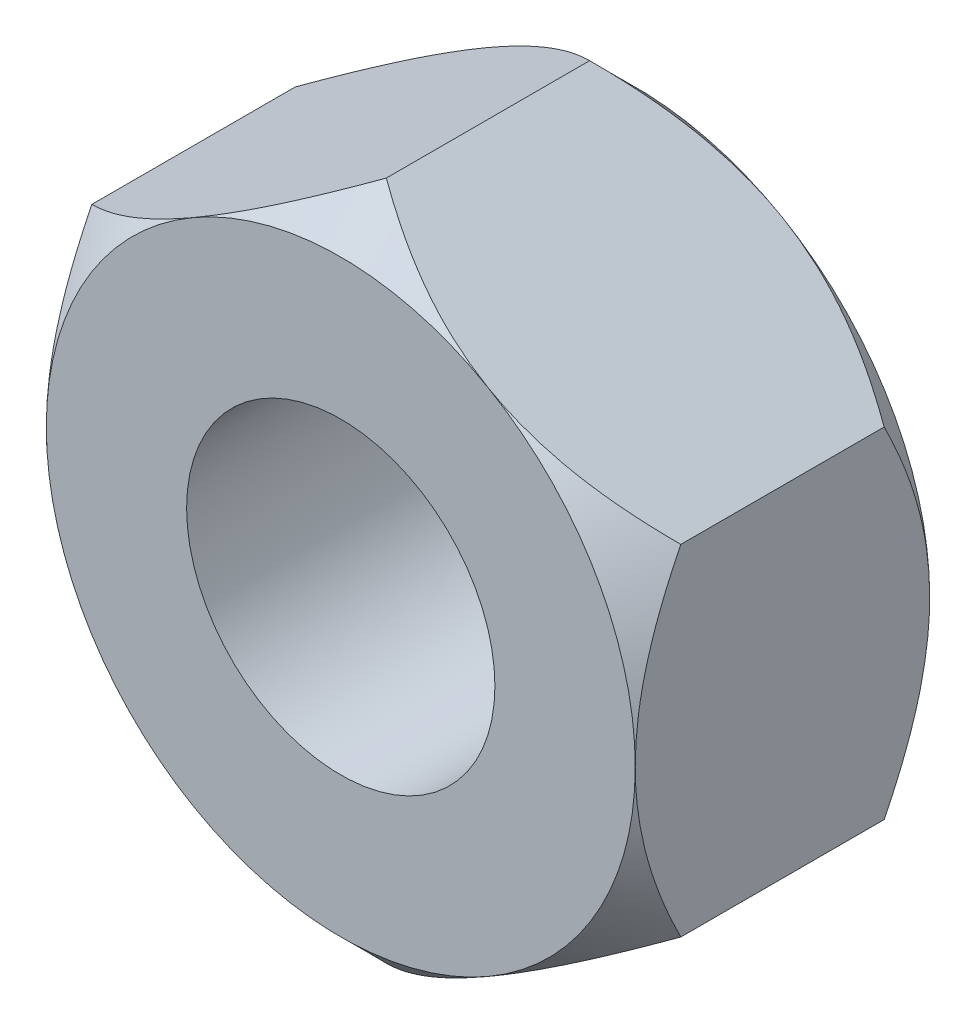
ISO-10303-21;
HEADER;
FILE_DESCRIPTION(('STEP AP214'),'2;1');
FILE_NAME('part.step','',(''),(''),'','','');
FILE_SCHEMA(('AUTOMOTIVE_DESIGN { 1 0 10303 214 1 1 1 1 }'));
ENDSEC;
DATA;
#1=APPLICATION_CONTEXT('core data for automotive mechanical design processes');
#2=APPLICATION_PROTOCOL_DEFINITION('international standard','automotive_design',2000,#1);
#3=PRODUCT_CONTEXT('',#1,'mechanical');
#4=PRODUCT('Part','Part','',(#3));
#5=PRODUCT_RELATED_PRODUCT_CATEGORY('part','',(#4));
#6=PRODUCT_DEFINITION_FORMATION('','',#4);
#7=PRODUCT_DEFINITION_CONTEXT('part definition',#1,'design');
#8=PRODUCT_DEFINITION('design','',#6,#7);
#9=PRODUCT_DEFINITION_SHAPE('','',#8);
#10=(LENGTH_UNIT() NAMED_UNIT(*) SI_UNIT(.MILLI.,.METRE.));
#11=(NAMED_UNIT(*) PLANE_ANGLE_UNIT() SI_UNIT($,.RADIAN.));
#12=(NAMED_UNIT(*) SI_UNIT($,.STERADIAN.) SOLID_ANGLE_UNIT());
#13=UNCERTAINTY_MEASURE_WITH_UNIT(LENGTH_MEASURE(1.E-05),#10,'distance_accuracy_value','');
#14=(GEOMETRIC_REPRESENTATION_CONTEXT(3) GLOBAL_UNCERTAINTY_ASSIGNED_CONTEXT((#13)) GLOBAL_UNIT_ASSIGNED_CONTEXT((#10,
#11,#12)) REPRESENTATION_CONTEXT('',''));
#15=CARTESIAN_POINT('',(0.,0.,0.));
#16=DIRECTION('',(0.,0.,1.));
#17=DIRECTION('',(1.,0.,0.));
#18=AXIS2_PLACEMENT_3D('',#15,#16,#17);
#19=CARTESIAN_POINT('',(-8.,4.61880215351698,4.));
#20=DIRECTION('',(-0.500000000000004,0.866025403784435,0.));
#21=DIRECTION('',(-0.866025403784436,-0.500000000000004,0.));
#22=AXIS2_PLACEMENT_3D('',#19,#20,#21);
#23=PLANE('',#22);
#24=DIRECTION('',(0.,0.,-1.));
#25=VECTOR('',#24,1.);
#26=CARTESIAN_POINT('',(-8.,4.61880215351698,4.));
#27=LINE('',#26,#25);
#28=CARTESIAN_POINT('',(-8.,4.61880215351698,2.76239569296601));
#29=VERTEX_POINT('',#28);
#30=CARTESIAN_POINT('',(-8.,4.61880215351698,-2.76239569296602));
#31=VERTEX_POINT('',#30);
#32=EDGE_CURVE('E205',#29,#31,#27,.T.);
#33=ORIENTED_EDGE('',*,*,#32,.F.);
#34=CARTESIAN_POINT('',(-8.00019999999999,4.61868668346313,2.76228022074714));
#35=CARTESIAN_POINT('',(-7.86264718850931,4.69810283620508,2.84168743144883));
#36=CARTESIAN_POINT('',(-7.72403708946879,4.77812941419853,2.91865771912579));
#37=CARTESIAN_POINT('',(-7.44449490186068,4.93952317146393,3.06698316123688));
#38=CARTESIAN_POINT('',(-7.3035615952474,5.0208910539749,3.13833524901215));
#39=CARTESIAN_POINT('',(-6.87565651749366,5.26794216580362,3.34346070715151));
#40=CARTESIAN_POINT('',(-6.58506238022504,5.43571676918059,3.46742824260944));
#41=CARTESIAN_POINT('',(-5.99905611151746,5.77404764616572,3.6797139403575));
#42=CARTESIAN_POINT('',(-5.70379374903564,5.94451745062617,3.76856690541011));
#43=CARTESIAN_POINT('',(-5.25604614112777,6.2030246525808,3.87134783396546));
#44=CARTESIAN_POINT('',(-5.10613774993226,6.28957430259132,3.90051131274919));
#45=CARTESIAN_POINT('',(-4.80505172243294,6.46340640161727,3.94801217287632));
#46=CARTESIAN_POINT('',(-4.65387427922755,6.55068873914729,3.96635117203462));
#47=CARTESIAN_POINT('',(-4.2854726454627,6.76338552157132,3.99709931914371));
#48=CARTESIAN_POINT('',(-4.06785151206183,6.88902914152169,4.00355065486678));
#49=CARTESIAN_POINT('',(-3.63300150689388,7.14008990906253,3.99272107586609));
#50=CARTESIAN_POINT('',(-3.4157727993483,7.26550696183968,3.97543184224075));
#51=CARTESIAN_POINT('',(-2.98336341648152,7.51515863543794,3.91814025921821));
#52=CARTESIAN_POINT('',(-2.76818530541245,7.63939177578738,3.87811251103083));
#53=CARTESIAN_POINT('',(-2.34152748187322,7.88572278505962,3.77752005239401));
#54=CARTESIAN_POINT('',(-2.13004748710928,8.00782081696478,3.71695691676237));
#55=CARTESIAN_POINT('',(-1.75463860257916,8.22456323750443,3.59236205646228));
#56=CARTESIAN_POINT('',(-1.58987832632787,8.31968762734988,3.53160757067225));
#57=CARTESIAN_POINT('',(-1.2633153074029,8.5082288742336,3.40030853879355));
#58=CARTESIAN_POINT('',(-1.10151265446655,8.601645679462,3.32976369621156));
#59=CARTESIAN_POINT('',(-0.781374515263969,8.78647752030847,3.18046522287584));
#60=CARTESIAN_POINT('',(-0.623029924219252,8.87789781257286,3.1017374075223));
#61=CARTESIAN_POINT('',(-0.309272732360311,9.0590456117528,2.93710651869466));
#62=CARTESIAN_POINT('',(-0.153858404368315,9.14877411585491,2.85120784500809));
#63=CARTESIAN_POINT('',(0.000200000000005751,9.23771977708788,2.7622802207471));
#64=B_SPLINE_CURVE_WITH_KNOTS('',3,(#34,#35,#36,#37,#38,#39,#40,#41,#42,#43,#44,#45,#46,#47,#48,
#49,#50,#51,#52,#53,#54,#55,#56,#57,#58,#59,#60,#61,#62,#63),.UNSPECIFIED.,.F.,.F.,(4,2,2,2,2,2,
2,2,2,2,2,2,2,2,4),(0.,0.532696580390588,1.06568194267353,2.13740664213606,3.19211397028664,
3.71843331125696,4.24467396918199,4.99761238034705,5.75081469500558,6.50485999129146,
7.25884747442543,7.85770857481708,8.45658781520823,9.05363199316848,9.65031250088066),.UNSPECIFIED.);
#65=CARTESIAN_POINT('',(-4.00000000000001,6.92820323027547,3.99999999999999));
#66=VERTEX_POINT('',#65);
#67=EDGE_CURVE('E129',#29,#66,#64,.T.);
#68=ORIENTED_EDGE('',*,*,#67,.T.);
#69=CARTESIAN_POINT('',(0.,9.23760430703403,2.76239569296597));
#70=VERTEX_POINT('',#69);
#71=EDGE_CURVE('E47',#66,#70,#64,.T.);
#72=ORIENTED_EDGE('',*,*,#71,.T.);
#73=DIRECTION('',(0.,0.,-1.));
#74=VECTOR('',#73,1.);
#75=CARTESIAN_POINT('',(0.,9.23760430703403,4.));
#76=LINE('',#75,#74);
#77=CARTESIAN_POINT('',(0.,9.23760430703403,-2.76239569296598));
#78=VERTEX_POINT('',#77);
#79=EDGE_CURVE('E258',#70,#78,#76,.T.);
#80=ORIENTED_EDGE('',*,*,#79,.T.);
#81=CARTESIAN_POINT('',(0.000200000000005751,9.23771977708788,-2.76228022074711));
#82=CARTESIAN_POINT('',(-0.137352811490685,9.15830362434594,-2.8416874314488));
#83=CARTESIAN_POINT('',(-0.27596291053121,9.07827704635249,-2.91865771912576));
#84=CARTESIAN_POINT('',(-0.555505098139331,8.91688328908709,-3.06698316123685));
#85=CARTESIAN_POINT('',(-0.696438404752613,8.83551540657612,-3.13833524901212));
#86=CARTESIAN_POINT('',(-1.12434348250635,8.58846429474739,-3.34346070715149));
#87=CARTESIAN_POINT('',(-1.41493761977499,8.42068969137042,-3.46742824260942));
#88=CARTESIAN_POINT('',(-2.00094388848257,8.08235881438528,-3.67971394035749));
#89=CARTESIAN_POINT('',(-2.2962062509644,7.91188900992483,-3.7685669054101));
#90=CARTESIAN_POINT('',(-2.74395385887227,7.6533818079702,-3.87134783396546));
#91=CARTESIAN_POINT('',(-2.8938622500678,7.56683215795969,-3.90051131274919));
#92=CARTESIAN_POINT('',(-3.19494827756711,7.39300005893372,-3.94801217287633));
#93=CARTESIAN_POINT('',(-3.3461257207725,7.30571772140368,-3.96635117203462));
#94=CARTESIAN_POINT('',(-3.71452735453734,7.09302093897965,-3.99709931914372));
#95=CARTESIAN_POINT('',(-3.93214848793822,6.9673773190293,-4.00355065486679));
#96=CARTESIAN_POINT('',(-4.36699849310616,6.71631655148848,-3.9927210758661));
#97=CARTESIAN_POINT('',(-4.58422720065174,6.59089949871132,-3.97543184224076));
#98=CARTESIAN_POINT('',(-5.01663658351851,6.34124782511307,-3.91814025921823));
#99=CARTESIAN_POINT('',(-5.23181469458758,6.21701468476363,-3.87811251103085));
#100=CARTESIAN_POINT('',(-5.6584725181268,5.97068367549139,-3.77752005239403));
#101=CARTESIAN_POINT('',(-5.86995251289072,5.8485856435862,-3.71695691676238));
#102=CARTESIAN_POINT('',(-6.24536139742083,5.63184322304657,-3.5923620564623));
#103=CARTESIAN_POINT('',(-6.41012167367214,5.53671883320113,-3.53160757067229));
#104=CARTESIAN_POINT('',(-6.73668469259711,5.34817758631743,-3.40030853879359));
#105=CARTESIAN_POINT('',(-6.89848734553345,5.25476078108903,-3.3297636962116));
#106=CARTESIAN_POINT('',(-7.21862548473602,5.06992894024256,-3.18046522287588));
#107=CARTESIAN_POINT('',(-7.37697007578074,4.97850864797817,-3.10173740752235));
#108=CARTESIAN_POINT('',(-7.69072726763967,4.79736084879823,-2.93710651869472));
#109=CARTESIAN_POINT('',(-7.84614159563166,4.70763234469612,-2.85120784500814));
#110=CARTESIAN_POINT('',(-8.00019999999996,4.61868668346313,-2.76228022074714));
#111=B_SPLINE_CURVE_WITH_KNOTS('',3,(#81,#82,#83,#84,#85,#86,#87,#88,#89,#90,#91,#92,#93,#94,
#95,#96,#97,#98,#99,#100,#101,#102,#103,#104,#105,#106,#107,#108,#109,#110),.UNSPECIFIED.,.F.,
.F.,(4,2,2,2,2,2,2,2,2,2,2,2,2,2,4),(0.,0.532696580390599,1.06568194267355,2.1374066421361,
3.1921139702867,3.71843331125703,4.24467396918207,4.99761238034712,5.75081469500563,
6.5048599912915,7.25884747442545,7.85770857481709,8.45658781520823,9.05363199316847,
9.65031250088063),.UNSPECIFIED.);
#112=CARTESIAN_POINT('',(-4.,6.92820323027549,-4.00000000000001));
#113=VERTEX_POINT('',#112);
#114=EDGE_CURVE('E200',#78,#113,#111,.T.);
#115=ORIENTED_EDGE('',*,*,#114,.T.);
#116=EDGE_CURVE('E197',#113,#31,#111,.T.);
#117=ORIENTED_EDGE('',*,*,#116,.T.);
#118=EDGE_LOOP('',(#33,#68,#72,#80,#115,#117));
#119=FACE_BOUND('',#118,.T.);
#120=ADVANCED_FACE('F32',(#119),#23,.T.);
#121=CARTESIAN_POINT('',(-8.,4.61880215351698,4.));
#122=DIRECTION('',(1.,0.,0.));
#123=DIRECTION('',(0.,1.,0.));
#124=AXIS2_PLACEMENT_3D('',#121,#122,#123);
#125=PLANE('',#124);
#126=CARTESIAN_POINT('',(-8.,-11.5676209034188,-2.06448909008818));
#127=CARTESIAN_POINT('',(-7.99999999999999,-11.2764434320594,-1.82506498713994));
#128=CARTESIAN_POINT('',(-7.99999999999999,-10.9838751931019,-1.58730576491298));
#129=CARTESIAN_POINT('',(-7.99999999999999,-10.3952440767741,-1.11600377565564));
#130=CARTESIAN_POINT('',(-7.99999999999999,-10.0991803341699,-0.882462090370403));
#131=CARTESIAN_POINT('',(-7.99999999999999,-9.49970837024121,-0.418060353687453));
#132=CARTESIAN_POINT('',(-7.99999999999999,-9.1962551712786,-0.187258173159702));
#133=CARTESIAN_POINT('',(-7.99999999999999,-8.58436142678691,0.267594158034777));
#134=CARTESIAN_POINT('',(-7.99999999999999,-8.27592137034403,0.491644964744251));
#135=CARTESIAN_POINT('',(-7.99999999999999,-7.62336356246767,0.952052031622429));
#136=CARTESIAN_POINT('',(-7.99999999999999,-7.27864037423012,1.18755489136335));
#137=CARTESIAN_POINT('',(-7.99999999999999,-6.58003782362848,1.64494735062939));
#138=CARTESIAN_POINT('',(-7.99999999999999,-6.22615547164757,1.86683242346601));
#139=CARTESIAN_POINT('',(-7.99999999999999,-5.50895275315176,2.29097102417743));
#140=CARTESIAN_POINT('',(-7.99999999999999,-5.14568402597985,2.49331118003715));
#141=CARTESIAN_POINT('',(-8.,-4.40610279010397,2.87240237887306));
#142=CARTESIAN_POINT('',(-8.,-4.02980207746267,3.0491758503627));
#143=CARTESIAN_POINT('',(-8.,-3.51033126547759,3.26459997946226));
#144=CARTESIAN_POINT('',(-8.,-3.37354003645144,3.31872721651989));
#145=CARTESIAN_POINT('',(-8.,-3.09809723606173,3.42201182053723));
#146=CARTESIAN_POINT('',(-8.,-2.95944567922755,3.47116922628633));
#147=CARTESIAN_POINT('',(-8.,-2.54066547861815,3.61038071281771));
#148=CARTESIAN_POINT('',(-7.99999999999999,-2.25770521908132,3.6921766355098));
#149=CARTESIAN_POINT('',(-8.,-1.69174941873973,3.8275882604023));
#150=CARTESIAN_POINT('',(-8.,-1.40889723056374,3.88179528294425));
#151=CARTESIAN_POINT('',(-7.99999999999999,-0.839103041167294,3.96105443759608));
#152=CARTESIAN_POINT('',(-7.99999999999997,-0.552162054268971,3.98611367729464));
#153=CARTESIAN_POINT('',(-7.99999999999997,0.00744758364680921,4.00462390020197));
#154=CARTESIAN_POINT('',(-7.99999999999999,0.280063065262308,3.99968613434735));
#155=CARTESIAN_POINT('',(-8.00000000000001,0.823385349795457,3.96230905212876));
#156=CARTESIAN_POINT('',(-8.,1.09409201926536,3.92986783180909));
#157=CARTESIAN_POINT('',(-8.,1.63636802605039,3.8388234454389));
#158=CARTESIAN_POINT('',(-8.00000000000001,1.90785304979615,3.77972710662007));
#159=CARTESIAN_POINT('',(-7.99999999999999,2.44474934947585,3.63880288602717));
#160=CARTESIAN_POINT('',(-7.99999999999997,2.71016071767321,3.55697534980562));
#161=CARTESIAN_POINT('',(-7.99999999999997,3.24015387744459,3.3724004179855));
#162=CARTESIAN_POINT('',(-7.99999999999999,3.50458571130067,3.26922792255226));
#163=CARTESIAN_POINT('',(-8.00000000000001,4.02669184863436,3.04687709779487));
#164=CARTESIAN_POINT('',(-8.,4.28436313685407,2.92769176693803));
#165=CARTESIAN_POINT('',(-8.,4.79413074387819,2.67613877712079));
#166=CARTESIAN_POINT('',(-8.,5.04620727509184,2.54373134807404));
#167=CARTESIAN_POINT('',(-8.,5.54460118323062,2.26863659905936));
#168=CARTESIAN_POINT('',(-8.,5.7909194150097,2.12595081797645));
#169=CARTESIAN_POINT('',(-8.,6.26648718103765,1.83955493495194));
#170=CARTESIAN_POINT('',(-8.,6.49597851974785,1.69624422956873));
#171=CARTESIAN_POINT('',(-8.,6.95101777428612,1.40347564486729));
#172=CARTESIAN_POINT('',(-8.,7.17656539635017,1.25401731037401));
#173=CARTESIAN_POINT('',(-8.,7.62243562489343,0.951248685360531));
#174=CARTESIAN_POINT('',(-8.,7.84278550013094,0.797978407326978));
#175=CARTESIAN_POINT('',(-8.,8.28045562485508,0.48729279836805));
#176=CARTESIAN_POINT('',(-8.,8.49777669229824,0.329878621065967));
#177=CARTESIAN_POINT('',(-8.,8.71382563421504,0.170766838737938));
#178=B_SPLINE_CURVE_WITH_KNOTS('',3,(#126,#127,#128,#129,#130,#131,#132,#133,#134,#135,#136,
#137,#138,#139,#140,#141,#142,#143,#144,#145,#146,#147,#148,#149,#150,#151,#152,#153,#154,#155,
#156,#157,#158,#159,#160,#161,#162,#163,#164,#165,#166,#167,#168,#169,#170,#171,#172,#173,#174,
#175,#176,#177),.UNSPECIFIED.,.F.,.F.,(4,2,2,2,2,2,2,2,2,2,2,2,2,2,2,2,2,2,2,2,2,2,2,2,2,4),(0.,
1.13093612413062,2.2621583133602,3.40584048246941,4.54941115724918,5.80163464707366,
7.05427215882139,8.30107499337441,9.54677734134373,9.98802711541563,10.4292734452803,
11.3117463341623,12.1744113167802,13.0368658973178,13.8534195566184,14.6700297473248,
15.5024113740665,16.334780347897,17.18567640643,18.0369457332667,18.8908574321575,
19.744641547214,20.5562154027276,21.3678494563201,22.1730384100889,22.9780055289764),.UNSPECIFIED.);
#179=CARTESIAN_POINT('',(-8.,0.,4.));
#180=VERTEX_POINT('',#179);
#181=EDGE_CURVE('E122',#29,#180,#178,.F.);
#182=ORIENTED_EDGE('',*,*,#181,.F.);
#183=ORIENTED_EDGE('',*,*,#32,.T.);
#184=CARTESIAN_POINT('',(-8.,-11.5676209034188,2.06448909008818));
#185=CARTESIAN_POINT('',(-7.99999999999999,-11.2764434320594,1.82506498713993));
#186=CARTESIAN_POINT('',(-7.99999999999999,-10.9838751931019,1.58730576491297));
#187=CARTESIAN_POINT('',(-7.99999999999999,-10.3952440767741,1.11600377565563));
#188=CARTESIAN_POINT('',(-7.99999999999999,-10.0991803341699,0.882462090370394));
#189=CARTESIAN_POINT('',(-7.99999999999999,-9.49970837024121,0.418060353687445));
#190=CARTESIAN_POINT('',(-7.99999999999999,-9.1962551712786,0.187258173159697));
#191=CARTESIAN_POINT('',(-7.99999999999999,-8.58436142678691,-0.267594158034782));
#192=CARTESIAN_POINT('',(-7.99999999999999,-8.27592137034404,-0.491644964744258));
#193=CARTESIAN_POINT('',(-7.99999999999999,-7.62336356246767,-0.952052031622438));
#194=CARTESIAN_POINT('',(-7.99999999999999,-7.27864037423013,-1.18755489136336));
#195=CARTESIAN_POINT('',(-7.99999999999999,-6.58003782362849,-1.6449473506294));
#196=CARTESIAN_POINT('',(-7.99999999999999,-6.22615547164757,-1.86683242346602));
#197=CARTESIAN_POINT('',(-8.,-5.50895275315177,-2.29097102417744));
#198=CARTESIAN_POINT('',(-8.,-5.14568402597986,-2.49331118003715));
#199=CARTESIAN_POINT('',(-7.99999999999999,-4.40610279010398,-2.87240237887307));
#200=CARTESIAN_POINT('',(-7.99999999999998,-4.02980207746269,-3.04917585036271));
#201=CARTESIAN_POINT('',(-7.99999999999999,-3.51033126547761,-3.26459997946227));
#202=CARTESIAN_POINT('',(-7.99999999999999,-3.37354003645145,-3.31872721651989));
#203=CARTESIAN_POINT('',(-8.,-3.09809723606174,-3.42201182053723));
#204=CARTESIAN_POINT('',(-7.99999999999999,-2.95944567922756,-3.47116922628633));
#205=CARTESIAN_POINT('',(-7.99999999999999,-2.54066547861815,-3.61038071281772));
#206=CARTESIAN_POINT('',(-7.99999999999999,-2.25770521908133,-3.69217663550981));
#207=CARTESIAN_POINT('',(-8.,-1.69174941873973,-3.82758826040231));
#208=CARTESIAN_POINT('',(-8.,-1.40889723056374,-3.88179528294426));
#209=CARTESIAN_POINT('',(-7.99999999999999,-0.839103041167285,-3.96105443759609));
#210=CARTESIAN_POINT('',(-7.99999999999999,-0.55216205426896,-3.98611367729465));
#211=CARTESIAN_POINT('',(-7.99999999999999,0.00744758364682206,-4.00462390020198));
#212=CARTESIAN_POINT('',(-7.99999999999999,0.280063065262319,-3.99968613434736));
#213=CARTESIAN_POINT('',(-8.,0.823385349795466,-3.96230905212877));
#214=CARTESIAN_POINT('',(-8.,1.09409201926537,-3.9298678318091));
#215=CARTESIAN_POINT('',(-8.,1.6363680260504,-3.83882344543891));
#216=CARTESIAN_POINT('',(-8.00000000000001,1.90785304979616,-3.77972710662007));
#217=CARTESIAN_POINT('',(-7.99999999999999,2.44474934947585,-3.63880288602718));
#218=CARTESIAN_POINT('',(-7.99999999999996,2.71016071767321,-3.55697534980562));
#219=CARTESIAN_POINT('',(-7.99999999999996,3.24015387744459,-3.37240041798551));
#220=CARTESIAN_POINT('',(-7.99999999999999,3.50458571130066,-3.26922792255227));
#221=CARTESIAN_POINT('',(-8.00000000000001,4.02669184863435,-3.04687709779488));
#222=CARTESIAN_POINT('',(-8.,4.28436313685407,-2.92769176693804));
#223=CARTESIAN_POINT('',(-8.,4.79413074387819,-2.6761387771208));
#224=CARTESIAN_POINT('',(-8.,5.04620727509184,-2.54373134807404));
#225=CARTESIAN_POINT('',(-8.,5.54460118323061,-2.26863659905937));
#226=CARTESIAN_POINT('',(-8.,5.7909194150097,-2.12595081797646));
#227=CARTESIAN_POINT('',(-8.,6.26648718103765,-1.83955493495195));
#228=CARTESIAN_POINT('',(-8.,6.49597851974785,-1.69624422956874));
#229=CARTESIAN_POINT('',(-8.,6.95101777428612,-1.40347564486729));
#230=CARTESIAN_POINT('',(-8.,7.17656539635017,-1.25401731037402));
#231=CARTESIAN_POINT('',(-8.,7.62243562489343,-0.951248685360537));
#232=CARTESIAN_POINT('',(-8.,7.84278550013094,-0.797978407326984));
#233=CARTESIAN_POINT('',(-8.,8.28045562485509,-0.487292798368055));
#234=CARTESIAN_POINT('',(-8.,8.49777669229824,-0.32987862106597));
#235=CARTESIAN_POINT('',(-8.,8.71382563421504,-0.170766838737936));
#236=B_SPLINE_CURVE_WITH_KNOTS('',3,(#184,#185,#186,#187,#188,#189,#190,#191,#192,#193,#194,
#195,#196,#197,#198,#199,#200,#201,#202,#203,#204,#205,#206,#207,#208,#209,#210,#211,#212,#213,
#214,#215,#216,#217,#218,#219,#220,#221,#222,#223,#224,#225,#226,#227,#228,#229,#230,#231,#232,
#233,#234,#235),.UNSPECIFIED.,.F.,.F.,(4,2,2,2,2,2,2,2,2,2,2,2,2,2,2,2,2,2,2,2,2,2,2,2,2,4),(0.,
1.13093612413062,2.2621583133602,3.40584048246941,4.54941115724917,5.80163464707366,
7.05427215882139,8.3010749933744,9.54677734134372,9.98802711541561,10.4292734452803,
11.3117463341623,12.1744113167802,13.0368658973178,13.8534195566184,14.6700297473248,
15.5024113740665,16.334780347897,17.18567640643,18.0369457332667,18.8908574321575,
19.744641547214,20.5562154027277,21.3678494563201,22.1730384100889,22.9780055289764),.UNSPECIFIED.);
#237=CARTESIAN_POINT('',(-7.99999999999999,0.,-4.00000000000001));
#238=VERTEX_POINT('',#237);
#239=EDGE_CURVE('E199',#238,#31,#236,.T.);
#240=ORIENTED_EDGE('',*,*,#239,.F.);
#241=CARTESIAN_POINT('',(-8.,-4.61880215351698,-2.76239569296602));
#242=VERTEX_POINT('',#241);
#243=EDGE_CURVE('E190',#242,#238,#236,.T.);
#244=ORIENTED_EDGE('',*,*,#243,.F.);
#245=DIRECTION('',(0.,0.,-1.));
#246=VECTOR('',#245,1.);
#247=CARTESIAN_POINT('',(-8.,-4.61880215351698,4.));
#248=LINE('',#247,#246);
#249=CARTESIAN_POINT('',(-8.,-4.61880215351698,2.76239569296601));
#250=VERTEX_POINT('',#249);
#251=EDGE_CURVE('E155',#250,#242,#248,.T.);
#252=ORIENTED_EDGE('',*,*,#251,.F.);
#253=EDGE_CURVE('E136',#180,#250,#178,.F.);
#254=ORIENTED_EDGE('',*,*,#253,.F.);
#255=EDGE_LOOP('',(#182,#183,#240,#244,#252,#254));
#256=FACE_BOUND('',#255,.T.);
#257=ADVANCED_FACE('F153',(#256),#125,.F.);
#258=CARTESIAN_POINT('',(-8.,-4.61880215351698,4.));
#259=DIRECTION('',(0.500000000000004,0.866025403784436,0.));
#260=DIRECTION('',(-0.866025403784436,0.500000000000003,0.));
#261=AXIS2_PLACEMENT_3D('',#258,#259,#260);
#262=PLANE('',#261);
#263=CARTESIAN_POINT('',(-8.00020000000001,-4.61868668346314,2.76228022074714));
#264=CARTESIAN_POINT('',(-7.86264718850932,-4.69810283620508,2.84168743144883));
#265=CARTESIAN_POINT('',(-7.7240370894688,-4.77812941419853,2.91865771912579));
#266=CARTESIAN_POINT('',(-7.44449490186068,-4.93952317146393,3.06698316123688));
#267=CARTESIAN_POINT('',(-7.3035615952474,-5.02089105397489,3.13833524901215));
#268=CARTESIAN_POINT('',(-6.87565651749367,-5.26794216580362,3.3434607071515));
#269=CARTESIAN_POINT('',(-6.58506238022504,-5.43571676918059,3.46742824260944));
#270=CARTESIAN_POINT('',(-5.99905611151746,-5.77404764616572,3.6797139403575));
#271=CARTESIAN_POINT('',(-5.70379374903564,-5.94451745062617,3.76856690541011));
#272=CARTESIAN_POINT('',(-5.25604614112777,-6.20302465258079,3.87134783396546));
#273=CARTESIAN_POINT('',(-5.10613774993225,-6.28957430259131,3.90051131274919));
#274=CARTESIAN_POINT('',(-4.80505172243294,-6.46340640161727,3.94801217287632));
#275=CARTESIAN_POINT('',(-4.65387427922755,-6.5506887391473,3.96635117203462));
#276=CARTESIAN_POINT('',(-4.28547264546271,-6.76338552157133,3.99709931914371));
#277=CARTESIAN_POINT('',(-4.06785151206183,-6.88902914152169,4.00355065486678));
#278=CARTESIAN_POINT('',(-3.63300150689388,-7.14008990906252,3.99272107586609));
#279=CARTESIAN_POINT('',(-3.4157727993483,-7.26550696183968,3.97543184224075));
#280=CARTESIAN_POINT('',(-2.98336341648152,-7.51515863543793,3.91814025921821));
#281=CARTESIAN_POINT('',(-2.76818530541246,-7.63939177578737,3.87811251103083));
#282=CARTESIAN_POINT('',(-2.34152748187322,-7.88572278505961,3.77752005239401));
#283=CARTESIAN_POINT('',(-2.13004748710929,-8.00782081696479,3.71695691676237));
#284=CARTESIAN_POINT('',(-1.75463860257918,-8.22456323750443,3.59236205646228));
#285=CARTESIAN_POINT('',(-1.58987832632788,-8.31968762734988,3.53160757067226));
#286=CARTESIAN_POINT('',(-1.26331530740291,-8.50822887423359,3.40030853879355));
#287=CARTESIAN_POINT('',(-1.10151265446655,-8.60164567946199,3.32976369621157));
#288=CARTESIAN_POINT('',(-0.781374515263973,-8.78647752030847,3.18046522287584));
#289=CARTESIAN_POINT('',(-0.623029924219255,-8.87789781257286,3.10173740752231));
#290=CARTESIAN_POINT('',(-0.309272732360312,-9.0590456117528,2.93710651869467));
#291=CARTESIAN_POINT('',(-0.153858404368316,-9.1487741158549,2.85120784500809));
#292=CARTESIAN_POINT('',(0.000200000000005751,-9.23771977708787,2.7622802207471));
#293=B_SPLINE_CURVE_WITH_KNOTS('',3,(#263,#264,#265,#266,#267,#268,#269,#270,#271,#272,#273,
#274,#275,#276,#277,#278,#279,#280,#281,#282,#283,#284,#285,#286,#287,#288,#289,#290,#291,#292),
.UNSPECIFIED.,.F.,.F.,(4,2,2,2,2,2,2,2,2,2,2,2,2,2,4),(0.,0.53269658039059,1.06568194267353,
2.13740664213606,3.19211397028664,3.71843331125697,4.244673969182,4.99761238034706,
5.75081469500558,6.50485999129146,7.25884747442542,7.85770857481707,8.45658781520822,
9.05363199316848,9.65031250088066),.UNSPECIFIED.);
#294=CARTESIAN_POINT('',(-4.00000000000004,-6.92820323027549,4.));
#295=VERTEX_POINT('',#294);
#296=EDGE_CURVE('E142',#250,#295,#293,.T.);
#297=ORIENTED_EDGE('',*,*,#296,.F.);
#298=ORIENTED_EDGE('',*,*,#251,.T.);
#299=CARTESIAN_POINT('',(0.000200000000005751,-9.23771977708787,-2.76228022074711));
#300=CARTESIAN_POINT('',(-0.137352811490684,-9.15830362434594,-2.8416874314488));
#301=CARTESIAN_POINT('',(-0.275962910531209,-9.07827704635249,-2.91865771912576));
#302=CARTESIAN_POINT('',(-0.555505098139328,-8.91688328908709,-3.06698316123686));
#303=CARTESIAN_POINT('',(-0.69643840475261,-8.83551540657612,-3.13833524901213));
#304=CARTESIAN_POINT('',(-1.12434348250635,-8.58846429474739,-3.34346070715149));
#305=CARTESIAN_POINT('',(-1.41493761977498,-8.42068969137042,-3.46742824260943));
#306=CARTESIAN_POINT('',(-2.00094388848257,-8.08235881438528,-3.6797139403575));
#307=CARTESIAN_POINT('',(-2.2962062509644,-7.91188900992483,-3.76856690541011));
#308=CARTESIAN_POINT('',(-2.74395385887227,-7.6533818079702,-3.87134783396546));
#309=CARTESIAN_POINT('',(-2.8938622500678,-7.56683215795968,-3.90051131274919));
#310=CARTESIAN_POINT('',(-3.19494827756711,-7.39300005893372,-3.94801217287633));
#311=CARTESIAN_POINT('',(-3.3461257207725,-7.30571772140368,-3.96635117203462));
#312=CARTESIAN_POINT('',(-3.71452735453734,-7.09302093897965,-3.99709931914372));
#313=CARTESIAN_POINT('',(-3.93214848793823,-6.9673773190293,-4.00355065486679));
#314=CARTESIAN_POINT('',(-4.36699849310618,-6.71631655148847,-3.9927210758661));
#315=CARTESIAN_POINT('',(-4.58422720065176,-6.59089949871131,-3.97543184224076));
#316=CARTESIAN_POINT('',(-5.01663658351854,-6.34124782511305,-3.91814025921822));
#317=CARTESIAN_POINT('',(-5.23181469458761,-6.21701468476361,-3.87811251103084));
#318=CARTESIAN_POINT('',(-5.65847251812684,-5.97068367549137,-3.77752005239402));
#319=CARTESIAN_POINT('',(-5.86995251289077,-5.84858564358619,-3.71695691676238));
#320=CARTESIAN_POINT('',(-6.24536139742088,-5.63184322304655,-3.59236205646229));
#321=CARTESIAN_POINT('',(-6.41012167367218,-5.53671883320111,-3.53160757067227));
#322=CARTESIAN_POINT('',(-6.73668469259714,-5.34817758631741,-3.40030853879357));
#323=CARTESIAN_POINT('',(-6.89848734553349,-5.25476078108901,-3.32976369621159));
#324=CARTESIAN_POINT('',(-7.21862548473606,-5.06992894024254,-3.18046522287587));
#325=CARTESIAN_POINT('',(-7.37697007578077,-4.97850864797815,-3.10173740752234));
#326=CARTESIAN_POINT('',(-7.6907272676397,-4.79736084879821,-2.9371065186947));
#327=CARTESIAN_POINT('',(-7.84614159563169,-4.70763234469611,-2.85120784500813));
#328=CARTESIAN_POINT('',(-8.00020000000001,-4.61868668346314,-2.76228022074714));
#329=B_SPLINE_CURVE_WITH_KNOTS('',3,(#299,#300,#301,#302,#303,#304,#305,#306,#307,#308,#309,
#310,#311,#312,#313,#314,#315,#316,#317,#318,#319,#320,#321,#322,#323,#324,#325,#326,#327,#328),
.UNSPECIFIED.,.F.,.F.,(4,2,2,2,2,2,2,2,2,2,2,2,2,2,4),(0.,0.532696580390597,1.06568194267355,
2.1374066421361,3.1921139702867,3.71843331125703,4.24467396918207,4.99761238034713,
5.75081469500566,6.50485999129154,7.25884747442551,7.85770857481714,8.45658781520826,
9.0536319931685,9.65031250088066),.UNSPECIFIED.);
#330=CARTESIAN_POINT('',(-4.00000000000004,-6.92820323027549,-4.));
#331=VERTEX_POINT('',#330);
#332=EDGE_CURVE('E198',#331,#242,#329,.T.);
#333=ORIENTED_EDGE('',*,*,#332,.F.);
#334=CARTESIAN_POINT('',(0.,-9.23760430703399,-2.76239569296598));
#335=VERTEX_POINT('',#334);
#336=EDGE_CURVE('E234',#335,#331,#329,.T.);
#337=ORIENTED_EDGE('',*,*,#336,.F.);
#338=DIRECTION('',(0.,0.,-1.));
#339=VECTOR('',#338,1.);
#340=CARTESIAN_POINT('',(0.,-9.23760430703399,4.));
#341=LINE('',#340,#339);
#342=CARTESIAN_POINT('',(0.,-9.23760430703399,2.76239569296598));
#343=VERTEX_POINT('',#342);
#344=EDGE_CURVE('E280',#343,#335,#341,.T.);
#345=ORIENTED_EDGE('',*,*,#344,.F.);
#346=EDGE_CURVE('E160',#295,#343,#293,.T.);
#347=ORIENTED_EDGE('',*,*,#346,.F.);
#348=EDGE_LOOP('',(#297,#298,#333,#337,#345,#347));
#349=FACE_BOUND('',#348,.T.);
#350=ADVANCED_FACE('F184',(#349),#262,.F.);
#351=CARTESIAN_POINT('',(8.00000000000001,-4.61880215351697,4.00000000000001));
#352=DIRECTION('',(0.500000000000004,-0.866025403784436,0.));
#353=DIRECTION('',(0.866025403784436,0.500000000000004,0.));
#354=AXIS2_PLACEMENT_3D('',#351,#352,#353);
#355=PLANE('',#354);
#356=DIRECTION('',(0.,0.,-1.));
#357=VECTOR('',#356,1.);
#358=CARTESIAN_POINT('',(8.00000000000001,-4.61880215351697,4.00000000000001));
#359=LINE('',#358,#357);
#360=CARTESIAN_POINT('',(8.00000000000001,-4.61880215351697,2.76239569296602));
#361=VERTEX_POINT('',#360);
#362=CARTESIAN_POINT('',(8.00000000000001,-4.61880215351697,-2.76239569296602));
#363=VERTEX_POINT('',#362);
#364=EDGE_CURVE('E278',#361,#363,#359,.T.);
#365=ORIENTED_EDGE('',*,*,#364,.F.);
#366=CARTESIAN_POINT('',(8.00020000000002,-4.61868668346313,2.76228022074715));
#367=CARTESIAN_POINT('',(7.86264718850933,-4.69810283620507,2.84168743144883));
#368=CARTESIAN_POINT('',(7.72403708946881,-4.77812941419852,2.91865771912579));
#369=CARTESIAN_POINT('',(7.44449490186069,-4.93952317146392,3.06698316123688));
#370=CARTESIAN_POINT('',(7.30356159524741,-5.02089105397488,3.13833524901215));
#371=CARTESIAN_POINT('',(6.87565651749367,-5.26794216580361,3.34346070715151));
#372=CARTESIAN_POINT('',(6.58506238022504,-5.43571676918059,3.46742824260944));
#373=CARTESIAN_POINT('',(5.99905611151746,-5.77404764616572,3.6797139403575));
#374=CARTESIAN_POINT('',(5.70379374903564,-5.94451745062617,3.76856690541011));
#375=CARTESIAN_POINT('',(5.25604614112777,-6.20302465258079,3.87134783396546));
#376=CARTESIAN_POINT('',(5.10613774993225,-6.28957430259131,3.90051131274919));
#377=CARTESIAN_POINT('',(4.80505172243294,-6.46340640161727,3.94801217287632));
#378=CARTESIAN_POINT('',(4.65387427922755,-6.5506887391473,3.96635117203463));
#379=CARTESIAN_POINT('',(4.28547264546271,-6.76338552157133,3.99709931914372));
#380=CARTESIAN_POINT('',(4.06785151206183,-6.88902914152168,4.00355065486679));
#381=CARTESIAN_POINT('',(3.63300150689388,-7.14008990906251,3.9927210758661));
#382=CARTESIAN_POINT('',(3.41577279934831,-7.26550696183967,3.97543184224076));
#383=CARTESIAN_POINT('',(2.98336341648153,-7.51515863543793,3.91814025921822));
#384=CARTESIAN_POINT('',(2.76818530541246,-7.63939177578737,3.87811251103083));
#385=CARTESIAN_POINT('',(2.34152748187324,-7.8857227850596,3.77752005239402));
#386=CARTESIAN_POINT('',(2.1300474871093,-8.00782081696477,3.71695691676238));
#387=CARTESIAN_POINT('',(1.75463860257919,-8.22456323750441,3.59236205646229));
#388=CARTESIAN_POINT('',(1.58987832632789,-8.31968762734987,3.53160757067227));
#389=CARTESIAN_POINT('',(1.26331530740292,-8.50822887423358,3.40030853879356));
#390=CARTESIAN_POINT('',(1.10151265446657,-8.60164567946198,3.32976369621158));
#391=CARTESIAN_POINT('',(0.781374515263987,-8.78647752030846,3.18046522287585));
#392=CARTESIAN_POINT('',(0.623029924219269,-8.87789781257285,3.10173740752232));
#393=CARTESIAN_POINT('',(0.309272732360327,-9.05904561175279,2.93710651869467));
#394=CARTESIAN_POINT('',(0.153858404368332,-9.1487741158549,2.8512078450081));
#395=CARTESIAN_POINT('',(-0.000199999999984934,-9.23771977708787,2.7622802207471));
#396=B_SPLINE_CURVE_WITH_KNOTS('',3,(#366,#367,#368,#369,#370,#371,#372,#373,#374,#375,#376,
#377,#378,#379,#380,#381,#382,#383,#384,#385,#386,#387,#388,#389,#390,#391,#392,#393,#394,#395),
.UNSPECIFIED.,.F.,.F.,(4,2,2,2,2,2,2,2,2,2,2,2,2,2,4),(0.,0.532696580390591,1.06568194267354,
2.13740664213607,3.19211397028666,3.71843331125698,4.24467396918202,4.99761238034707,
5.75081469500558,6.50485999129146,7.25884747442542,7.85770857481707,8.45658781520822,
9.05363199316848,9.65031250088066),.UNSPECIFIED.);
#397=CARTESIAN_POINT('',(4.00000000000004,-6.92820323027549,4.00000000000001));
#398=VERTEX_POINT('',#397);
#399=EDGE_CURVE('E134',#361,#398,#396,.T.);
#400=ORIENTED_EDGE('',*,*,#399,.T.);
#401=EDGE_CURVE('E133',#398,#343,#396,.T.);
#402=ORIENTED_EDGE('',*,*,#401,.T.);
#403=ORIENTED_EDGE('',*,*,#344,.T.);
#404=CARTESIAN_POINT('',(-0.000199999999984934,-9.23771977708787,-2.76228022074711));
#405=CARTESIAN_POINT('',(0.137352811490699,-9.15830362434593,-2.84168743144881));
#406=CARTESIAN_POINT('',(0.275962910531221,-9.07827704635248,-2.91865771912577));
#407=CARTESIAN_POINT('',(0.555505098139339,-8.91688328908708,-3.06698316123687));
#408=CARTESIAN_POINT('',(0.696438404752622,-8.83551540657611,-3.13833524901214));
#409=CARTESIAN_POINT('',(1.12434348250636,-8.58846429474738,-3.3434607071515));
#410=CARTESIAN_POINT('',(1.41493761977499,-8.42068969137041,-3.46742824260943));
#411=CARTESIAN_POINT('',(2.00094388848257,-8.08235881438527,-3.6797139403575));
#412=CARTESIAN_POINT('',(2.2962062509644,-7.91188900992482,-3.76856690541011));
#413=CARTESIAN_POINT('',(2.74395385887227,-7.6533818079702,-3.87134783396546));
#414=CARTESIAN_POINT('',(2.8938622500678,-7.56683215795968,-3.9005113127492));
#415=CARTESIAN_POINT('',(3.19494827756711,-7.39300005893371,-3.94801217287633));
#416=CARTESIAN_POINT('',(3.3461257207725,-7.30571772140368,-3.96635117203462));
#417=CARTESIAN_POINT('',(3.71452735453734,-7.09302093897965,-3.99709931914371));
#418=CARTESIAN_POINT('',(3.93214848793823,-6.96737731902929,-4.00355065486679));
#419=CARTESIAN_POINT('',(4.36699849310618,-6.71631655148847,-3.99272107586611));
#420=CARTESIAN_POINT('',(4.58422720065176,-6.59089949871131,-3.97543184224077));
#421=CARTESIAN_POINT('',(5.01663658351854,-6.34124782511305,-3.91814025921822));
#422=CARTESIAN_POINT('',(5.23181469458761,-6.21701468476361,-3.87811251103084));
#423=CARTESIAN_POINT('',(5.65847251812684,-5.97068367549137,-3.77752005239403));
#424=CARTESIAN_POINT('',(5.86995251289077,-5.84858564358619,-3.71695691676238));
#425=CARTESIAN_POINT('',(6.24536139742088,-5.63184322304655,-3.5923620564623));
#426=CARTESIAN_POINT('',(6.41012167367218,-5.53671883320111,-3.53160757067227));
#427=CARTESIAN_POINT('',(6.73668469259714,-5.3481775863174,-3.40030853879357));
#428=CARTESIAN_POINT('',(6.89848734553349,-5.254760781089,-3.32976369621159));
#429=CARTESIAN_POINT('',(7.21862548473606,-5.06992894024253,-3.18046522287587));
#430=CARTESIAN_POINT('',(7.37697007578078,-4.97850864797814,-3.10173740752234));
#431=CARTESIAN_POINT('',(7.69072726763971,-4.7973608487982,-2.9371065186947));
#432=CARTESIAN_POINT('',(7.8461415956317,-4.7076323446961,-2.85120784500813));
#433=CARTESIAN_POINT('',(8.00020000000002,-4.61868668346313,-2.76228022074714));
#434=B_SPLINE_CURVE_WITH_KNOTS('',3,(#404,#405,#406,#407,#408,#409,#410,#411,#412,#413,#414,
#415,#416,#417,#418,#419,#420,#421,#422,#423,#424,#425,#426,#427,#428,#429,#430,#431,#432,#433),
.UNSPECIFIED.,.F.,.F.,(4,2,2,2,2,2,2,2,2,2,2,2,2,2,4),(0.,0.532696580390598,1.06568194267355,
2.13740664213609,3.19211397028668,3.71843331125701,4.24467396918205,4.99761238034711,
5.75081469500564,6.50485999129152,7.25884747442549,7.85770857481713,8.45658781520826,
9.0536319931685,9.65031250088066),.UNSPECIFIED.);
#435=CARTESIAN_POINT('',(4.00000000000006,-6.92820323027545,-4.));
#436=VERTEX_POINT('',#435);
#437=EDGE_CURVE('E238',#335,#436,#434,.T.);
#438=ORIENTED_EDGE('',*,*,#437,.T.);
#439=EDGE_CURVE('E230',#436,#363,#434,.T.);
#440=ORIENTED_EDGE('',*,*,#439,.T.);
#441=EDGE_LOOP('',(#365,#400,#402,#403,#438,#440));
#442=FACE_BOUND('',#441,.T.);
#443=ADVANCED_FACE('F313',(#442),#355,.T.);
#444=CARTESIAN_POINT('',(8.00000000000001,4.61880215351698,4.));
#445=DIRECTION('',(1.,0.,0.));
#446=DIRECTION('',(0.,0.999999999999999,0.));
#447=AXIS2_PLACEMENT_3D('',#444,#445,#446);
#448=PLANE('',#447);
#449=DIRECTION('',(0.,0.,-1.));
#450=VECTOR('',#449,1.);
#451=CARTESIAN_POINT('',(8.00000000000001,4.61880215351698,4.));
#452=LINE('',#451,#450);
#453=CARTESIAN_POINT('',(8.00000000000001,4.61880215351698,2.76239569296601));
#454=VERTEX_POINT('',#453);
#455=CARTESIAN_POINT('',(8.00000000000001,4.61880215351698,-2.76239569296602));
#456=VERTEX_POINT('',#455);
#457=EDGE_CURVE('E259',#454,#456,#452,.T.);
#458=ORIENTED_EDGE('',*,*,#457,.F.);
#459=CARTESIAN_POINT('',(8.,-11.5676209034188,-2.06448909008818));
#460=CARTESIAN_POINT('',(8.00000000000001,-11.2764434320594,-1.82506498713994));
#461=CARTESIAN_POINT('',(8.00000000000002,-10.9838751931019,-1.58730576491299));
#462=CARTESIAN_POINT('',(8.00000000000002,-10.3952440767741,-1.11600377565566));
#463=CARTESIAN_POINT('',(8.00000000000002,-10.0991803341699,-0.882462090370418));
#464=CARTESIAN_POINT('',(8.00000000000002,-9.49970837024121,-0.418060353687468));
#465=CARTESIAN_POINT('',(8.00000000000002,-9.19625517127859,-0.187258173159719));
#466=CARTESIAN_POINT('',(8.00000000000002,-8.5843614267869,0.267594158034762));
#467=CARTESIAN_POINT('',(8.00000000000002,-8.27592137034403,0.49164496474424));
#468=CARTESIAN_POINT('',(8.00000000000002,-7.62336356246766,0.95205203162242));
#469=CARTESIAN_POINT('',(8.00000000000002,-7.27864037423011,1.18755489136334));
#470=CARTESIAN_POINT('',(8.00000000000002,-6.58003782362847,1.64494735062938));
#471=CARTESIAN_POINT('',(8.00000000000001,-6.22615547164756,1.866832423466));
#472=CARTESIAN_POINT('',(8.00000000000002,-5.50895275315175,2.29097102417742));
#473=CARTESIAN_POINT('',(8.00000000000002,-5.14568402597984,2.49331118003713));
#474=CARTESIAN_POINT('',(8.00000000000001,-4.40610279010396,2.87240237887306));
#475=CARTESIAN_POINT('',(7.99999999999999,-4.02980207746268,3.04917585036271));
#476=CARTESIAN_POINT('',(8.,-3.51033126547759,3.26459997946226));
#477=CARTESIAN_POINT('',(8.00000000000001,-3.37354003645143,3.31872721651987));
#478=CARTESIAN_POINT('',(8.00000000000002,-3.09809723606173,3.42201182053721));
#479=CARTESIAN_POINT('',(8.00000000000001,-2.95944567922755,3.47116922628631));
#480=CARTESIAN_POINT('',(8.00000000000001,-2.54066547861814,3.6103807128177));
#481=CARTESIAN_POINT('',(8.00000000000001,-2.25770521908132,3.69217663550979));
#482=CARTESIAN_POINT('',(8.00000000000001,-1.69174941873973,3.82758826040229));
#483=CARTESIAN_POINT('',(8.00000000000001,-1.40889723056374,3.88179528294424));
#484=CARTESIAN_POINT('',(8.00000000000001,-0.839103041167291,3.96105443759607));
#485=CARTESIAN_POINT('',(8.00000000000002,-0.55216205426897,3.98611367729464));
#486=CARTESIAN_POINT('',(8.00000000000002,0.00744758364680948,4.00462390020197));
#487=CARTESIAN_POINT('',(8.00000000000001,0.280063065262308,3.99968613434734));
#488=CARTESIAN_POINT('',(8.00000000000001,0.82338534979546,3.96230905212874));
#489=CARTESIAN_POINT('',(8.00000000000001,1.09409201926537,3.92986783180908));
#490=CARTESIAN_POINT('',(8.00000000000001,1.63636802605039,3.83882344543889));
#491=CARTESIAN_POINT('',(8.00000000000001,1.90785304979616,3.77972710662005));
#492=CARTESIAN_POINT('',(8.00000000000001,2.44474934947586,3.63880288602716));
#493=CARTESIAN_POINT('',(8.,2.71016071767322,3.55697534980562));
#494=CARTESIAN_POINT('',(8.,3.2401538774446,3.37240041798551));
#495=CARTESIAN_POINT('',(8.00000000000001,3.50458571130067,3.26922792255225));
#496=CARTESIAN_POINT('',(8.00000000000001,4.02669184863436,3.04687709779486));
#497=CARTESIAN_POINT('',(8.00000000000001,4.28436313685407,2.92769176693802));
#498=CARTESIAN_POINT('',(8.00000000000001,4.79413074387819,2.67613877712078));
#499=CARTESIAN_POINT('',(8.00000000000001,5.04620727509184,2.54373134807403));
#500=CARTESIAN_POINT('',(8.00000000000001,5.54460118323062,2.26863659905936));
#501=CARTESIAN_POINT('',(8.00000000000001,5.7909194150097,2.12595081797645));
#502=CARTESIAN_POINT('',(8.00000000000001,6.26648718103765,1.83955493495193));
#503=CARTESIAN_POINT('',(8.00000000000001,6.49597851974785,1.69624422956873));
#504=CARTESIAN_POINT('',(8.00000000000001,6.95101777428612,1.40347564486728));
#505=CARTESIAN_POINT('',(8.00000000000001,7.17656539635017,1.25401731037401));
#506=CARTESIAN_POINT('',(8.00000000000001,7.62243562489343,0.951248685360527));
#507=CARTESIAN_POINT('',(8.00000000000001,7.84278550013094,0.797978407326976));
#508=CARTESIAN_POINT('',(8.00000000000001,8.28045562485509,0.487292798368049));
#509=CARTESIAN_POINT('',(8.,8.49777669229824,0.329878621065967));
#510=CARTESIAN_POINT('',(8.,8.71382563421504,0.170766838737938));
#511=B_SPLINE_CURVE_WITH_KNOTS('',3,(#459,#460,#461,#462,#463,#464,#465,#466,#467,#468,#469,
#470,#471,#472,#473,#474,#475,#476,#477,#478,#479,#480,#481,#482,#483,#484,#485,#486,#487,#488,
#489,#490,#491,#492,#493,#494,#495,#496,#497,#498,#499,#500,#501,#502,#503,#504,#505,#506,#507,
#508,#509,#510),.UNSPECIFIED.,.F.,.F.,(4,2,2,2,2,2,2,2,2,2,2,2,2,2,2,2,2,2,2,2,2,2,2,2,2,4),(0.,
1.13093612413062,2.2621583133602,3.40584048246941,4.54941115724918,5.80163464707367,
7.0542721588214,8.30107499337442,9.54677734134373,9.98802711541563,10.4292734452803,
11.3117463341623,12.1744113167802,13.0368658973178,13.8534195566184,14.6700297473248,
15.5024113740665,16.334780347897,17.18567640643,18.0369457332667,18.8908574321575,
19.744641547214,20.5562154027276,21.3678494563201,22.1730384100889,22.9780055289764),.UNSPECIFIED.);
#512=CARTESIAN_POINT('',(8.00000000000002,0.,4.));
#513=VERTEX_POINT('',#512);
#514=EDGE_CURVE('E288',#454,#513,#511,.F.);
#515=ORIENTED_EDGE('',*,*,#514,.T.);
#516=EDGE_CURVE('E55',#513,#361,#511,.F.);
#517=ORIENTED_EDGE('',*,*,#516,.T.);
#518=ORIENTED_EDGE('',*,*,#364,.T.);
#519=CARTESIAN_POINT('',(8.,-11.5676209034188,2.06448909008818));
#520=CARTESIAN_POINT('',(8.00000000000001,-11.2764434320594,1.82506498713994));
#521=CARTESIAN_POINT('',(8.00000000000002,-10.9838751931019,1.58730576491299));
#522=CARTESIAN_POINT('',(8.00000000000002,-10.3952440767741,1.11600377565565));
#523=CARTESIAN_POINT('',(8.00000000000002,-10.0991803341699,0.882462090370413));
#524=CARTESIAN_POINT('',(8.00000000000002,-9.49970837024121,0.418060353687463));
#525=CARTESIAN_POINT('',(8.00000000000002,-9.1962551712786,0.187258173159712));
#526=CARTESIAN_POINT('',(8.00000000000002,-8.58436142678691,-0.267594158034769));
#527=CARTESIAN_POINT('',(8.00000000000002,-8.27592137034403,-0.491644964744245));
#528=CARTESIAN_POINT('',(8.00000000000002,-7.62336356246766,-0.952052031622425));
#529=CARTESIAN_POINT('',(8.00000000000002,-7.27864037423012,-1.18755489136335));
#530=CARTESIAN_POINT('',(8.00000000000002,-6.58003782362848,-1.64494735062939));
#531=CARTESIAN_POINT('',(8.00000000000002,-6.22615547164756,-1.86683242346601));
#532=CARTESIAN_POINT('',(8.00000000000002,-5.50895275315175,-2.29097102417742));
#533=CARTESIAN_POINT('',(8.00000000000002,-5.14568402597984,-2.49331118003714));
#534=CARTESIAN_POINT('',(8.00000000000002,-4.40610279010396,-2.87240237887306));
#535=CARTESIAN_POINT('',(8.00000000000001,-4.02980207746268,-3.04917585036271));
#536=CARTESIAN_POINT('',(8.00000000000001,-3.51033126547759,-3.26459997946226));
#537=CARTESIAN_POINT('',(8.00000000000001,-3.37354003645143,-3.31872721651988));
#538=CARTESIAN_POINT('',(8.00000000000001,-3.09809723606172,-3.42201182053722));
#539=CARTESIAN_POINT('',(8.00000000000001,-2.95944567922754,-3.47116922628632));
#540=CARTESIAN_POINT('',(8.00000000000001,-2.54066547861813,-3.6103807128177));
#541=CARTESIAN_POINT('',(8.00000000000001,-2.25770521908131,-3.6921766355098));
#542=CARTESIAN_POINT('',(8.00000000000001,-1.69174941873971,-3.8275882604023));
#543=CARTESIAN_POINT('',(8.00000000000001,-1.40889723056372,-3.88179528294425));
#544=CARTESIAN_POINT('',(8.00000000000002,-0.83910304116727,-3.96105443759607));
#545=CARTESIAN_POINT('',(8.00000000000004,-0.552162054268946,-3.98611367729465));
#546=CARTESIAN_POINT('',(8.00000000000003,0.00744758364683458,-4.00462390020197));
#547=CARTESIAN_POINT('',(8.00000000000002,0.280063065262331,-3.99968613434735));
#548=CARTESIAN_POINT('',(8.00000000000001,0.823385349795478,-3.96230905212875));
#549=CARTESIAN_POINT('',(8.00000000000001,1.09409201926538,-3.92986783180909));
#550=CARTESIAN_POINT('',(8.00000000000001,1.63636802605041,-3.83882344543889));
#551=CARTESIAN_POINT('',(8.00000000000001,1.90785304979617,-3.77972710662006));
#552=CARTESIAN_POINT('',(8.00000000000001,2.44474934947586,-3.63880288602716));
#553=CARTESIAN_POINT('',(8.00000000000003,2.71016071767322,-3.55697534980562));
#554=CARTESIAN_POINT('',(8.00000000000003,3.2401538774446,-3.37240041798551));
#555=CARTESIAN_POINT('',(8.00000000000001,3.50458571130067,-3.26922792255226));
#556=CARTESIAN_POINT('',(8.,4.02669184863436,-3.04687709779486));
#557=CARTESIAN_POINT('',(8.00000000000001,4.28436313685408,-2.92769176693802));
#558=CARTESIAN_POINT('',(8.00000000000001,4.79413074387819,-2.67613877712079));
#559=CARTESIAN_POINT('',(8.00000000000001,5.04620727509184,-2.54373134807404));
#560=CARTESIAN_POINT('',(8.00000000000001,5.54460118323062,-2.26863659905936));
#561=CARTESIAN_POINT('',(8.00000000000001,5.7909194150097,-2.12595081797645));
#562=CARTESIAN_POINT('',(8.00000000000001,6.26648718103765,-1.83955493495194));
#563=CARTESIAN_POINT('',(8.00000000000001,6.49597851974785,-1.69624422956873));
#564=CARTESIAN_POINT('',(8.00000000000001,6.95101777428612,-1.40347564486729));
#565=CARTESIAN_POINT('',(8.00000000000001,7.17656539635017,-1.25401731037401));
#566=CARTESIAN_POINT('',(8.00000000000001,7.62243562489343,-0.951248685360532));
#567=CARTESIAN_POINT('',(8.00000000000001,7.84278550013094,-0.79797840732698));
#568=CARTESIAN_POINT('',(8.00000000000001,8.28045562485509,-0.487292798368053));
#569=CARTESIAN_POINT('',(8.,8.49777669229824,-0.32987862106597));
#570=CARTESIAN_POINT('',(8.,8.71382563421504,-0.170766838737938));
#571=B_SPLINE_CURVE_WITH_KNOTS('',3,(#519,#520,#521,#522,#523,#524,#525,#526,#527,#528,#529,
#530,#531,#532,#533,#534,#535,#536,#537,#538,#539,#540,#541,#542,#543,#544,#545,#546,#547,#548,
#549,#550,#551,#552,#553,#554,#555,#556,#557,#558,#559,#560,#561,#562,#563,#564,#565,#566,#567,
#568,#569,#570),.UNSPECIFIED.,.F.,.F.,(4,2,2,2,2,2,2,2,2,2,2,2,2,2,2,2,2,2,2,2,2,2,2,2,2,4),(0.,
1.13093612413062,2.2621583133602,3.40584048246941,4.54941115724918,5.80163464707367,
7.05427215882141,8.30107499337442,9.54677734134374,9.98802711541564,10.4292734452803,
11.3117463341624,12.1744113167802,13.0368658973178,13.8534195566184,14.6700297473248,
15.5024113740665,16.334780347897,17.18567640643,18.0369457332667,18.8908574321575,
19.744641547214,20.5562154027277,21.3678494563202,22.1730384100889,22.9780055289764),.UNSPECIFIED.);
#572=CARTESIAN_POINT('',(8.00000000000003,0.,-4.));
#573=VERTEX_POINT('',#572);
#574=EDGE_CURVE('E475',#363,#573,#571,.T.);
#575=ORIENTED_EDGE('',*,*,#574,.T.);
#576=EDGE_CURVE('E223',#573,#456,#571,.T.);
#577=ORIENTED_EDGE('',*,*,#576,.T.);
#578=EDGE_LOOP('',(#458,#515,#517,#518,#575,#577));
#579=FACE_BOUND('',#578,.T.);
#580=ADVANCED_FACE('F308',(#579),#448,.T.);
#581=CARTESIAN_POINT('',(8.00000000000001,4.61880215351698,4.));
#582=DIRECTION('',(-0.500000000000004,-0.866025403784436,0.));
#583=DIRECTION('',(0.866025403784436,-0.500000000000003,0.));
#584=AXIS2_PLACEMENT_3D('',#581,#582,#583);
#585=PLANE('',#584);
#586=CARTESIAN_POINT('',(8.00020000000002,4.61868668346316,2.76228022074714));
#587=CARTESIAN_POINT('',(7.86264718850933,4.69810283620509,2.84168743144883));
#588=CARTESIAN_POINT('',(7.7240370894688,4.77812941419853,2.91865771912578));
#589=CARTESIAN_POINT('',(7.44449490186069,4.93952317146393,3.06698316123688));
#590=CARTESIAN_POINT('',(7.30356159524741,5.02089105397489,3.13833524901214));
#591=CARTESIAN_POINT('',(6.87565651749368,5.26794216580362,3.3434607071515));
#592=CARTESIAN_POINT('',(6.58506238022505,5.43571676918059,3.46742824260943));
#593=CARTESIAN_POINT('',(5.99905611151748,5.77404764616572,3.6797139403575));
#594=CARTESIAN_POINT('',(5.70379374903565,5.94451745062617,3.7685669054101));
#595=CARTESIAN_POINT('',(5.25604614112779,6.20302465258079,3.87134783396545));
#596=CARTESIAN_POINT('',(5.10613774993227,6.28957430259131,3.90051131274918));
#597=CARTESIAN_POINT('',(4.80505172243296,6.46340640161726,3.94801217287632));
#598=CARTESIAN_POINT('',(4.65387427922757,6.55068873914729,3.96635117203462));
#599=CARTESIAN_POINT('',(4.28547264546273,6.76338552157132,3.99709931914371));
#600=CARTESIAN_POINT('',(4.06785151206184,6.88902914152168,4.00355065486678));
#601=CARTESIAN_POINT('',(3.63300150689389,7.14008990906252,3.99272107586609));
#602=CARTESIAN_POINT('',(3.41577279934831,7.26550696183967,3.97543184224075));
#603=CARTESIAN_POINT('',(2.98336341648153,7.51515863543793,3.91814025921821));
#604=CARTESIAN_POINT('',(2.76818530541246,7.63939177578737,3.87811251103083));
#605=CARTESIAN_POINT('',(2.34152748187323,7.88572278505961,3.77752005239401));
#606=CARTESIAN_POINT('',(2.1300474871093,8.00782081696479,3.71695691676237));
#607=CARTESIAN_POINT('',(1.75463860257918,8.22456323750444,3.59236205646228));
#608=CARTESIAN_POINT('',(1.58987832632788,8.31968762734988,3.53160757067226));
#609=CARTESIAN_POINT('',(1.26331530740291,8.50822887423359,3.40030853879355));
#610=CARTESIAN_POINT('',(1.10151265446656,8.60164567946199,3.32976369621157));
#611=CARTESIAN_POINT('',(0.781374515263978,8.78647752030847,3.18046522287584));
#612=CARTESIAN_POINT('',(0.62302992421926,8.87789781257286,3.10173740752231));
#613=CARTESIAN_POINT('',(0.309272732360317,9.0590456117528,2.93710651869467));
#614=CARTESIAN_POINT('',(0.153858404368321,9.1487741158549,2.85120784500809));
#615=CARTESIAN_POINT('',(-0.000199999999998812,9.23771977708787,2.7622802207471));
#616=B_SPLINE_CURVE_WITH_KNOTS('',3,(#586,#587,#588,#589,#590,#591,#592,#593,#594,#595,#596,
#597,#598,#599,#600,#601,#602,#603,#604,#605,#606,#607,#608,#609,#610,#611,#612,#613,#614,#615),
.UNSPECIFIED.,.F.,.F.,(4,2,2,2,2,2,2,2,2,2,2,2,2,2,4),(0.,0.532696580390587,1.06568194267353,
2.13740664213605,3.19211397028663,3.71843331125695,4.24467396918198,4.99761238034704,
5.75081469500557,6.50485999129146,7.25884747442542,7.85770857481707,8.45658781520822,
9.05363199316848,9.65031250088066),.UNSPECIFIED.);
#617=CARTESIAN_POINT('',(4.00000000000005,6.92820323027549,4.));
#618=VERTEX_POINT('',#617);
#619=EDGE_CURVE('E295',#454,#618,#616,.T.);
#620=ORIENTED_EDGE('',*,*,#619,.F.);
#621=ORIENTED_EDGE('',*,*,#457,.T.);
#622=CARTESIAN_POINT('',(-0.000199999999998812,9.23771977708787,-2.76228022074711));
#623=CARTESIAN_POINT('',(0.13735281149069,9.15830362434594,-2.84168743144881));
#624=CARTESIAN_POINT('',(0.275962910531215,9.07827704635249,-2.91865771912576));
#625=CARTESIAN_POINT('',(0.555505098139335,8.91688328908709,-3.06698316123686));
#626=CARTESIAN_POINT('',(0.696438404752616,8.83551540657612,-3.13833524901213));
#627=CARTESIAN_POINT('',(1.12434348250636,8.58846429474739,-3.34346070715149));
#628=CARTESIAN_POINT('',(1.41493761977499,8.42068969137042,-3.46742824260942));
#629=CARTESIAN_POINT('',(2.00094388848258,8.08235881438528,-3.6797139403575));
#630=CARTESIAN_POINT('',(2.2962062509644,7.91188900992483,-3.76856690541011));
#631=CARTESIAN_POINT('',(2.74395385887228,7.6533818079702,-3.87134783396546));
#632=CARTESIAN_POINT('',(2.8938622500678,7.56683215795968,-3.90051131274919));
#633=CARTESIAN_POINT('',(3.19494827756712,7.39300005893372,-3.94801217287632));
#634=CARTESIAN_POINT('',(3.34612572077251,7.3057177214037,-3.96635117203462));
#635=CARTESIAN_POINT('',(3.71452735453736,7.09302093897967,-3.99709931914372));
#636=CARTESIAN_POINT('',(3.93214848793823,6.9673773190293,-4.00355065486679));
#637=CARTESIAN_POINT('',(4.36699849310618,6.71631655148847,-3.9927210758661));
#638=CARTESIAN_POINT('',(4.58422720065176,6.59089949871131,-3.97543184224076));
#639=CARTESIAN_POINT('',(5.01663658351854,6.34124782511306,-3.91814025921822));
#640=CARTESIAN_POINT('',(5.23181469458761,6.21701468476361,-3.87811251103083));
#641=CARTESIAN_POINT('',(5.65847251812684,5.97068367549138,-3.77752005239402));
#642=CARTESIAN_POINT('',(5.86995251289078,5.8485856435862,-3.71695691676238));
#643=CARTESIAN_POINT('',(6.24536139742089,5.63184322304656,-3.5923620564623));
#644=CARTESIAN_POINT('',(6.41012167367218,5.53671883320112,-3.53160757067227));
#645=CARTESIAN_POINT('',(6.73668469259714,5.34817758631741,-3.40030853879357));
#646=CARTESIAN_POINT('',(6.89848734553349,5.25476078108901,-3.32976369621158));
#647=CARTESIAN_POINT('',(7.21862548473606,5.06992894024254,-3.18046522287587));
#648=CARTESIAN_POINT('',(7.37697007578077,4.97850864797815,-3.10173740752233));
#649=CARTESIAN_POINT('',(7.6907272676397,4.79736084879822,-2.9371065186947));
#650=CARTESIAN_POINT('',(7.8461415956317,4.70763234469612,-2.85120784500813));
#651=CARTESIAN_POINT('',(8.00020000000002,4.61868668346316,-2.76228022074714));
#652=B_SPLINE_CURVE_WITH_KNOTS('',3,(#622,#623,#624,#625,#626,#627,#628,#629,#630,#631,#632,
#633,#634,#635,#636,#637,#638,#639,#640,#641,#642,#643,#644,#645,#646,#647,#648,#649,#650,#651),
.UNSPECIFIED.,.F.,.F.,(4,2,2,2,2,2,2,2,2,2,2,2,2,2,4),(0.,0.532696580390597,1.06568194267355,
2.13740664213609,3.19211397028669,3.71843331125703,4.24467396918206,4.99761238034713,
5.75081469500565,6.50485999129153,7.2588474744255,7.85770857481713,8.45658781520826,
9.0536319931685,9.65031250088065),.UNSPECIFIED.);
#653=CARTESIAN_POINT('',(4.00000000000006,6.92820323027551,-4.00000000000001));
#654=VERTEX_POINT('',#653);
#655=EDGE_CURVE('E158',#654,#456,#652,.T.);
#656=ORIENTED_EDGE('',*,*,#655,.F.);
#657=EDGE_CURVE('E267',#78,#654,#652,.T.);
#658=ORIENTED_EDGE('',*,*,#657,.F.);
#659=ORIENTED_EDGE('',*,*,#79,.F.);
#660=EDGE_CURVE('E149',#618,#70,#616,.T.);
#661=ORIENTED_EDGE('',*,*,#660,.F.);
#662=EDGE_LOOP('',(#620,#621,#656,#658,#659,#661));
#663=FACE_BOUND('',#662,.T.);
#664=ADVANCED_FACE('F305',(#663),#585,.F.);
#665=CARTESIAN_POINT('',(0.,0.,-4.00000000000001));
#666=DIRECTION('',(0.,0.,1.));
#667=DIRECTION('',(1.,0.,0.));
#668=AXIS2_PLACEMENT_3D('',#665,#666,#667);
#669=CONICAL_SURFACE('',#668,8.,0.785398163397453);
#670=ORIENTED_EDGE('',*,*,#243,.T.);
#671=CARTESIAN_POINT('',(0.,0.,-4.00000000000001));
#672=DIRECTION('',(0.,0.,-1.));
#673=DIRECTION('',(-1.,0.,0.));
#674=AXIS2_PLACEMENT_3D('',#671,#672,#673);
#675=CIRCLE('',#674,8.);
#676=EDGE_CURVE('E251',#331,#238,#675,.T.);
#677=ORIENTED_EDGE('',*,*,#676,.F.);
#678=ORIENTED_EDGE('',*,*,#332,.T.);
#679=EDGE_LOOP('',(#670,#677,#678));
#680=FACE_BOUND('',#679,.T.);
#681=ADVANCED_FACE('F249',(#680),#669,.T.);
#682=ORIENTED_EDGE('',*,*,#336,.T.);
#683=EDGE_CURVE('E274',#436,#331,#675,.T.);
#684=ORIENTED_EDGE('',*,*,#683,.F.);
#685=ORIENTED_EDGE('',*,*,#437,.F.);
#686=EDGE_LOOP('',(#682,#684,#685));
#687=FACE_BOUND('',#686,.T.);
#688=ADVANCED_FACE('F358',(#687),#669,.T.);
#689=EDGE_CURVE('E275',#573,#436,#675,.T.);
#690=ORIENTED_EDGE('',*,*,#689,.F.);
#691=ORIENTED_EDGE('',*,*,#574,.F.);
#692=ORIENTED_EDGE('',*,*,#439,.F.);
#693=EDGE_LOOP('',(#690,#691,#692));
#694=FACE_BOUND('',#693,.T.);
#695=ADVANCED_FACE('F211',(#694),#669,.T.);
#696=EDGE_CURVE('E272',#654,#573,#675,.T.);
#697=ORIENTED_EDGE('',*,*,#696,.F.);
#698=ORIENTED_EDGE('',*,*,#655,.T.);
#699=ORIENTED_EDGE('',*,*,#576,.F.);
#700=EDGE_LOOP('',(#697,#698,#699));
#701=FACE_BOUND('',#700,.T.);
#702=ADVANCED_FACE('F207',(#701),#669,.T.);
#703=ORIENTED_EDGE('',*,*,#657,.T.);
#704=EDGE_CURVE('E147',#113,#654,#675,.T.);
#705=ORIENTED_EDGE('',*,*,#704,.F.);
#706=ORIENTED_EDGE('',*,*,#114,.F.);
#707=EDGE_LOOP('',(#703,#705,#706));
#708=FACE_BOUND('',#707,.T.);
#709=ADVANCED_FACE('F210',(#708),#669,.T.);
#710=ORIENTED_EDGE('',*,*,#239,.T.);
#711=ORIENTED_EDGE('',*,*,#116,.F.);
#712=CARTESIAN_POINT('',(0.,0.,-4.00000000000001));
#713=DIRECTION('',(0.,0.,-1.));
#714=DIRECTION('',(-1.,0.,0.));
#715=AXIS2_PLACEMENT_3D('',#712,#713,#714);
#716=CIRCLE('',#715,8.);
#717=EDGE_CURVE('E156',#238,#113,#716,.T.);
#718=ORIENTED_EDGE('',*,*,#717,.F.);
#719=EDGE_LOOP('',(#710,#711,#718));
#720=FACE_BOUND('',#719,.T.);
#721=ADVANCED_FACE('F213',(#720),#669,.T.);
#722=CARTESIAN_POINT('',(-15.9999999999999,0.,-4.00000000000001));
#723=DIRECTION('',(0.,0.,-1.));
#724=DIRECTION('',(-1.,0.,0.));
#725=AXIS2_PLACEMENT_3D('',#722,#723,#724);
#726=PLANE('',#725);
#727=CARTESIAN_POINT('',(0.,0.,-4.00000000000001));
#728=DIRECTION('',(0.,0.,1.));
#729=DIRECTION('',(1.,0.,0.));
#730=AXIS2_PLACEMENT_3D('',#727,#728,#729);
#731=CIRCLE('',#730,4.188);
#732=CARTESIAN_POINT('',(4.188,0.,-4.00000000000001));
#733=VERTEX_POINT('',#732);
#734=EDGE_CURVE('E150',#733,#733,#731,.T.);
#735=ORIENTED_EDGE('',*,*,#734,.T.);
#736=EDGE_LOOP('',(#735));
#737=FACE_BOUND('',#736,.T.);
#738=ORIENTED_EDGE('',*,*,#676,.T.);
#739=ORIENTED_EDGE('',*,*,#717,.T.);
#740=ORIENTED_EDGE('',*,*,#704,.T.);
#741=ORIENTED_EDGE('',*,*,#696,.T.);
#742=ORIENTED_EDGE('',*,*,#689,.T.);
#743=ORIENTED_EDGE('',*,*,#683,.T.);
#744=EDGE_LOOP('',(#738,#739,#740,#741,#742,#743));
#745=FACE_BOUND('',#744,.T.);
#746=ADVANCED_FACE('F185',(#737,#745),#726,.T.);
#747=CARTESIAN_POINT('',(0.,0.,4.));
#748=DIRECTION('',(0.,0.,-1.));
#749=DIRECTION('',(1.,0.,0.));
#750=AXIS2_PLACEMENT_3D('',#747,#748,#749);
#751=CONICAL_SURFACE('',#750,8.,0.785398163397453);
#752=ORIENTED_EDGE('',*,*,#253,.T.);
#753=ORIENTED_EDGE('',*,*,#296,.T.);
#754=CARTESIAN_POINT('',(0.,0.,4.));
#755=DIRECTION('',(0.,0.,-1.));
#756=DIRECTION('',(-1.,0.,0.));
#757=AXIS2_PLACEMENT_3D('',#754,#755,#756);
#758=CIRCLE('',#757,8.);
#759=EDGE_CURVE('E36',#295,#180,#758,.T.);
#760=ORIENTED_EDGE('',*,*,#759,.T.);
#761=EDGE_LOOP('',(#752,#753,#760));
#762=FACE_BOUND('',#761,.T.);
#763=ADVANCED_FACE('F140',(#762),#751,.T.);
#764=ORIENTED_EDGE('',*,*,#346,.T.);
#765=ORIENTED_EDGE('',*,*,#401,.F.);
#766=EDGE_CURVE('E146',#398,#295,#758,.T.);
#767=ORIENTED_EDGE('',*,*,#766,.T.);
#768=EDGE_LOOP('',(#764,#765,#767));
#769=FACE_BOUND('',#768,.T.);
#770=ADVANCED_FACE('F409',(#769),#751,.T.);
#771=ORIENTED_EDGE('',*,*,#516,.F.);
#772=EDGE_CURVE('E485',#513,#398,#758,.T.);
#773=ORIENTED_EDGE('',*,*,#772,.T.);
#774=ORIENTED_EDGE('',*,*,#399,.F.);
#775=EDGE_LOOP('',(#771,#773,#774));
#776=FACE_BOUND('',#775,.T.);
#777=ADVANCED_FACE('F417',(#776),#751,.T.);
#778=ORIENTED_EDGE('',*,*,#619,.T.);
#779=EDGE_CURVE('E41',#618,#513,#758,.T.);
#780=ORIENTED_EDGE('',*,*,#779,.T.);
#781=ORIENTED_EDGE('',*,*,#514,.F.);
#782=EDGE_LOOP('',(#778,#780,#781));
#783=FACE_BOUND('',#782,.T.);
#784=ADVANCED_FACE('F177',(#783),#751,.T.);
#785=EDGE_CURVE('E11',#66,#618,#758,.T.);
#786=ORIENTED_EDGE('',*,*,#785,.T.);
#787=ORIENTED_EDGE('',*,*,#660,.T.);
#788=ORIENTED_EDGE('',*,*,#71,.F.);
#789=EDGE_LOOP('',(#786,#787,#788));
#790=FACE_BOUND('',#789,.T.);
#791=ADVANCED_FACE('F425',(#790),#751,.T.);
#792=ORIENTED_EDGE('',*,*,#181,.T.);
#793=CARTESIAN_POINT('',(0.,0.,4.));
#794=DIRECTION('',(0.,0.,-1.));
#795=DIRECTION('',(-1.,0.,0.));
#796=AXIS2_PLACEMENT_3D('',#793,#794,#795);
#797=CIRCLE('',#796,8.);
#798=EDGE_CURVE('E126',#180,#66,#797,.T.);
#799=ORIENTED_EDGE('',*,*,#798,.T.);
#800=ORIENTED_EDGE('',*,*,#67,.F.);
#801=EDGE_LOOP('',(#792,#799,#800));
#802=FACE_BOUND('',#801,.T.);
#803=ADVANCED_FACE('F124',(#802),#751,.T.);
#804=CARTESIAN_POINT('',(-15.9999999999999,0.,4.));
#805=DIRECTION('',(0.,0.,-1.));
#806=DIRECTION('',(-1.,0.,0.));
#807=AXIS2_PLACEMENT_3D('',#804,#805,#806);
#808=PLANE('',#807);
#809=CARTESIAN_POINT('',(0.,0.,4.));
#810=DIRECTION('',(0.,0.,1.));
#811=DIRECTION('',(1.,0.,0.));
#812=AXIS2_PLACEMENT_3D('',#809,#810,#811);
#813=CIRCLE('',#812,4.188);
#814=CARTESIAN_POINT('',(4.188,0.,4.));
#815=VERTEX_POINT('',#814);
#816=EDGE_CURVE('E470',#815,#815,#813,.T.);
#817=ORIENTED_EDGE('',*,*,#816,.F.);
#818=EDGE_LOOP('',(#817));
#819=FACE_BOUND('',#818,.T.);
#820=ORIENTED_EDGE('',*,*,#798,.F.);
#821=ORIENTED_EDGE('',*,*,#759,.F.);
#822=ORIENTED_EDGE('',*,*,#766,.F.);
#823=ORIENTED_EDGE('',*,*,#772,.F.);
#824=ORIENTED_EDGE('',*,*,#779,.F.);
#825=ORIENTED_EDGE('',*,*,#785,.F.);
#826=EDGE_LOOP('',(#820,#821,#822,#823,#824,#825));
#827=FACE_BOUND('',#826,.T.);
#828=ADVANCED_FACE('F148',(#819,#827),#808,.F.);
#829=CARTESIAN_POINT('',(0.,0.,-4.00000000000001));
#830=DIRECTION('',(0.,0.,1.));
#831=DIRECTION('',(1.,0.,0.));
#832=AXIS2_PLACEMENT_3D('',#829,#830,#831);
#833=CYLINDRICAL_SURFACE('',#832,4.188);
#834=ORIENTED_EDGE('',*,*,#734,.F.);
#835=EDGE_LOOP('',(#834));
#836=FACE_BOUND('',#835,.T.);
#837=ORIENTED_EDGE('',*,*,#816,.T.);
#838=EDGE_LOOP('',(#837));
#839=FACE_BOUND('',#838,.T.);
#840=ADVANCED_FACE('F454',(#836,#839),#833,.F.);
#841=CLOSED_SHELL('',(#120,#257,#350,#443,#580,#664,#681,#688,#695,#702,#709,#721,#746,#763,
#770,#777,#784,#791,#803,#828,#840));
#842=MANIFOLD_SOLID_BREP('B2',#841);
#843=ADVANCED_BREP_SHAPE_REPRESENTATION('',(#18,#842),#14);
#844=SHAPE_DEFINITION_REPRESENTATION(#9,#843);
ENDSEC;
END-ISO-10303-21;
